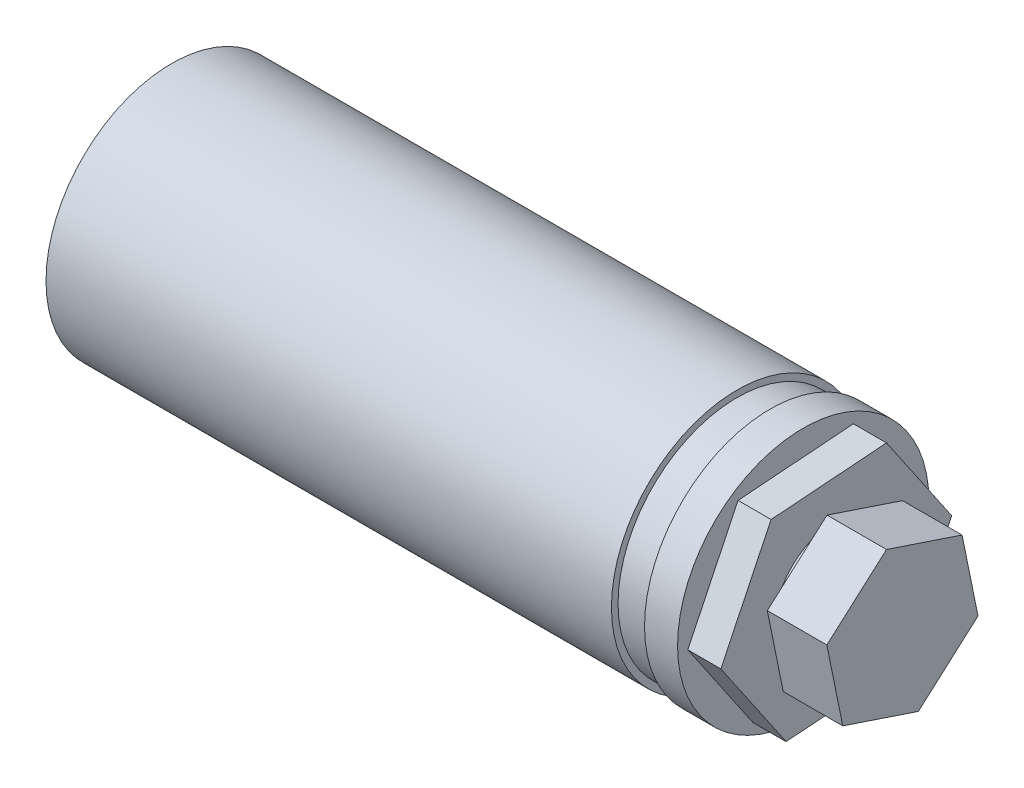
from build123d import *

# Parameters (mm, degrees)
SALIENTE_EXTRUIR1_DEPTH = 5
CROQUIS3_R              = 9.5
SALIENTE_EXTRUIR2_DEPTH = 1
SALIENTE_EXTRUIR3_DEPTH = 9


with BuildPart() as part:
    # Croquis1 → Revoluci_n1 (revolve)
    with BuildSketch(Plane.XY, mode=Mode.PRIVATE) as revoluci_n1_sk:
        Polygon((0, 0), (0, 19), (85.5, 19), (85.5, 18), (90.5, 18), (90.5, 19), (95.5, 19), (95.5, 0), align=None)
    revolve(revoluci_n1_sk.sketch.rotate(Axis((0, 0, 0), (1, 0, 0)), 90), axis=Axis((0, 0, 0), (1, 0, 0)))

    # Croquis2 → Saliente-Extruir1 (add)
    with BuildSketch(Plane(origin=(95.5, 0, 0), x_dir=(0, 0, -1), z_dir=(1, 0, 0))):
        Polygon((-9.858996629, 14.458567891), (-17.450985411, -1.308857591), (-7.591988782, -15.767425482), (9.858996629, -14.458567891), (17.450985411, 1.308857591), (7.591988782, 15.767425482), align=None)
    extrude(amount=SALIENTE_EXTRUIR1_DEPTH)

    # Croquis3 → Saliente-Extruir2 (add)
    with BuildSketch(Plane(origin=(100.5, 0, 0), x_dir=(0, 0, -1), z_dir=(1, 0, 0))):
        Circle(CROQUIS3_R)
    extrude(amount=SALIENTE_EXTRUIR2_DEPTH)

    # Croquis4 → Saliente-Extruir3 (add)
    with BuildSketch(Plane(origin=(101.5, 0, 0), x_dir=(0, 0, -1), z_dir=(1, 0, 0))):
        Polygon((-2.407030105, 11.807146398), (-11.42880378, 3.819023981), (-9.021773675, -7.988122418), (2.407030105, -11.807146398), (11.42880378, -3.819023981), (9.021773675, 7.988122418), align=None)
    extrude(amount=SALIENTE_EXTRUIR3_DEPTH)


solid = part.part
